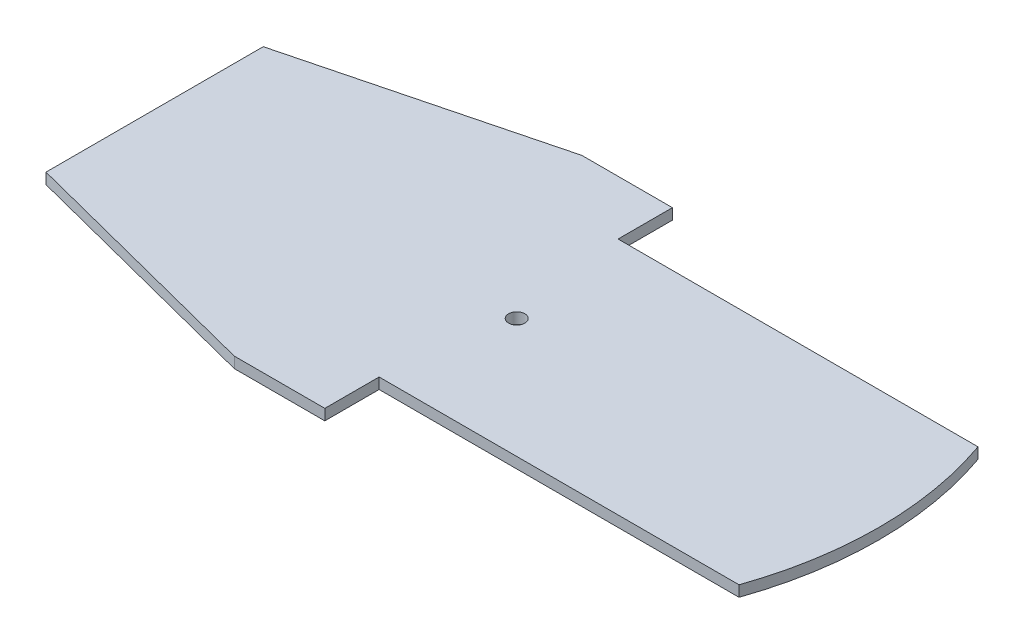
from build123d import *

# Parameters (mm, degrees)
SKETCH1_R           = 2.25
BOSS_EXTRUDE1_DEPTH = 3


with BuildPart() as part:
    # Sketch1 → Boss-Extrude1 (new body)
    with BuildSketch(Plane(origin=(0, 0, 0), x_dir=(1, 0, 0), z_dir=(0, 1, 0))):
        with BuildLine():
            Line((-100, -30), (-100, 30))
            Line((-100, 30), (-30, 48))
            Line((-30, 48), (-5, 48))
            Line((-5, 48), (-5, 33))
            Line((-5, 33), (94.398093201, 33))
            ThreePointArc((94.398093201, 33), (100, 0), (94.398093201, -33))
            Line((94.398093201, -33), (-5, -33))
            Line((-5, -33), (-5, -48))
            Line((-5, -48), (-30, -48))
            Line((-30, -48), (-100, -30))
        make_face()
        with Locations(Location((0, 0, 0), (0, 0, 270))):
            Circle(SKETCH1_R, mode=Mode.SUBTRACT)
    extrude(amount=BOSS_EXTRUDE1_DEPTH)


solid = part.part
